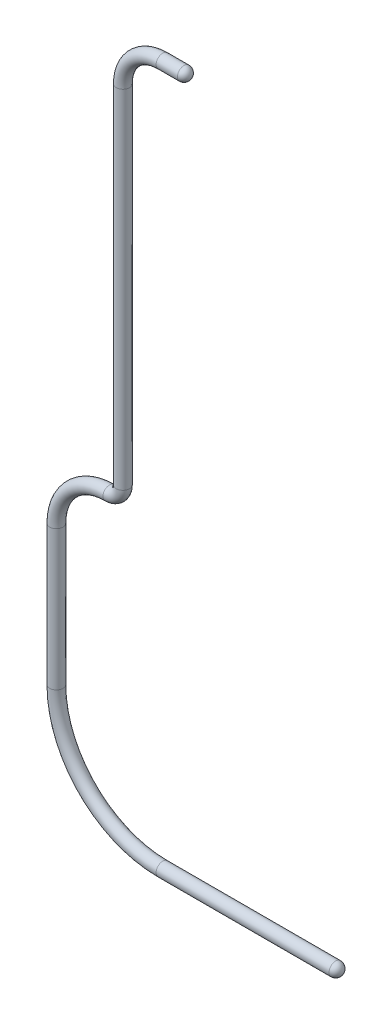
ISO-10303-21;
HEADER;
FILE_DESCRIPTION(('STEP AP214'),'2;1');
FILE_NAME('part.step','',(''),(''),'','','');
FILE_SCHEMA(('AUTOMOTIVE_DESIGN { 1 0 10303 214 1 1 1 1 }'));
ENDSEC;
DATA;
#1=APPLICATION_CONTEXT('core data for automotive mechanical design processes');
#2=APPLICATION_PROTOCOL_DEFINITION('international standard','automotive_design',2000,#1);
#3=PRODUCT_CONTEXT('',#1,'mechanical');
#4=PRODUCT('Part','Part','',(#3));
#5=PRODUCT_RELATED_PRODUCT_CATEGORY('part','',(#4));
#6=PRODUCT_DEFINITION_FORMATION('','',#4);
#7=PRODUCT_DEFINITION_CONTEXT('part definition',#1,'design');
#8=PRODUCT_DEFINITION('design','',#6,#7);
#9=PRODUCT_DEFINITION_SHAPE('','',#8);
#10=(LENGTH_UNIT() NAMED_UNIT(*) SI_UNIT(.MILLI.,.METRE.));
#11=(NAMED_UNIT(*) PLANE_ANGLE_UNIT() SI_UNIT($,.RADIAN.));
#12=(NAMED_UNIT(*) SI_UNIT($,.STERADIAN.) SOLID_ANGLE_UNIT());
#13=UNCERTAINTY_MEASURE_WITH_UNIT(LENGTH_MEASURE(1.E-05),#10,'distance_accuracy_value','');
#14=(GEOMETRIC_REPRESENTATION_CONTEXT(3) GLOBAL_UNCERTAINTY_ASSIGNED_CONTEXT((#13)) GLOBAL_UNIT_ASSIGNED_CONTEXT((#10,
#11,#12)) REPRESENTATION_CONTEXT('',''));
#15=CARTESIAN_POINT('',(0.,0.,0.));
#16=DIRECTION('',(0.,0.,1.));
#17=DIRECTION('',(1.,0.,0.));
#18=AXIS2_PLACEMENT_3D('',#15,#16,#17);
#19=CARTESIAN_POINT('',(-65.,-147.5,0.));
#20=DIRECTION('',(1.,0.,0.));
#21=DIRECTION('',(0.,0.,-1.));
#22=AXIS2_PLACEMENT_3D('',#19,#20,#21);
#23=CYLINDRICAL_SURFACE('',#22,2.5);
#24=CARTESIAN_POINT('',(0.,-147.5,0.));
#25=DIRECTION('',(1.,0.,0.));
#26=DIRECTION('',(0.,1.,0.));
#27=AXIS2_PLACEMENT_3D('',#24,#25,#26);
#28=CIRCLE('',#27,2.5);
#29=CARTESIAN_POINT('',(0.,-147.5,-2.5));
#30=VERTEX_POINT('',#29);
#31=CARTESIAN_POINT('',(0.,-147.5,2.5));
#32=VERTEX_POINT('',#31);
#33=EDGE_CURVE('E59',#30,#32,#28,.T.);
#34=ORIENTED_EDGE('',*,*,#33,.F.);
#35=CARTESIAN_POINT('',(0.,-147.5,0.));
#36=DIRECTION('',(-1.,0.,0.));
#37=DIRECTION('',(0.,-1.,0.));
#38=AXIS2_PLACEMENT_3D('',#35,#36,#37);
#39=CIRCLE('',#38,2.5);
#40=EDGE_CURVE('E37',#30,#32,#39,.T.);
#41=ORIENTED_EDGE('',*,*,#40,.T.);
#42=EDGE_LOOP('',(#34,#41));
#43=FACE_BOUND('',#42,.T.);
#44=CARTESIAN_POINT('',(-65.,-147.5,0.));
#45=DIRECTION('',(-1.,0.,0.));
#46=DIRECTION('',(0.,-1.,0.));
#47=AXIS2_PLACEMENT_3D('',#44,#45,#46);
#48=CIRCLE('',#47,2.5);
#49=CARTESIAN_POINT('',(-65.,-150.,0.));
#50=VERTEX_POINT('',#49);
#51=EDGE_CURVE('E11',#50,#50,#48,.T.);
#52=ORIENTED_EDGE('',*,*,#51,.F.);
#53=EDGE_LOOP('',(#52));
#54=FACE_BOUND('',#53,.T.);
#55=ADVANCED_FACE('F16',(#43,#54),#23,.T.);
#56=CARTESIAN_POINT('',(-65.,-107.5,0.));
#57=DIRECTION('',(0.,0.,-1.));
#58=DIRECTION('',(1.,0.,0.));
#59=AXIS2_PLACEMENT_3D('',#56,#57,#58);
#60=TOROIDAL_SURFACE('',#59,40.,2.5);
#61=CARTESIAN_POINT('',(-105.,-107.5,0.));
#62=DIRECTION('',(0.,1.,0.));
#63=DIRECTION('',(1.,0.,0.));
#64=AXIS2_PLACEMENT_3D('',#61,#62,#63);
#65=CIRCLE('',#64,2.5);
#66=CARTESIAN_POINT('',(-107.5,-107.5,0.));
#67=VERTEX_POINT('',#66);
#68=EDGE_CURVE('E24',#67,#67,#65,.T.);
#69=CARTESIAN_POINT('',(-65.,-107.5,0.));
#70=DIRECTION('',(0.,0.,-1.));
#71=DIRECTION('',(1.,0.,0.));
#72=AXIS2_PLACEMENT_3D('',#69,#70,#71);
#73=CIRCLE('',#72,42.5);
#74=EDGE_CURVE('',#50,#67,#73,.T.);
#75=ORIENTED_EDGE('',*,*,#51,.T.);
#76=ORIENTED_EDGE('',*,*,#68,.F.);
#77=ORIENTED_EDGE('',*,*,#74,.T.);
#78=ORIENTED_EDGE('',*,*,#74,.F.);
#79=EDGE_LOOP('',(#75,#77,#76,#78));
#80=FACE_BOUND('',#79,.T.);
#81=ADVANCED_FACE('F95',(#80),#60,.T.);
#82=CARTESIAN_POINT('',(-105.,-55.,0.));
#83=DIRECTION('',(0.,-1.,0.));
#84=DIRECTION('',(0.,0.,-1.));
#85=AXIS2_PLACEMENT_3D('',#82,#83,#84);
#86=CYLINDRICAL_SURFACE('',#85,2.5);
#87=ORIENTED_EDGE('',*,*,#68,.T.);
#88=EDGE_LOOP('',(#87));
#89=FACE_BOUND('',#88,.T.);
#90=CARTESIAN_POINT('',(-105.,-55.,0.));
#91=DIRECTION('',(0.,1.,0.));
#92=DIRECTION('',(1.,0.,0.));
#93=AXIS2_PLACEMENT_3D('',#90,#91,#92);
#94=CIRCLE('',#93,2.5);
#95=CARTESIAN_POINT('',(-107.5,-55.,0.));
#96=VERTEX_POINT('',#95);
#97=EDGE_CURVE('E79',#96,#96,#94,.T.);
#98=ORIENTED_EDGE('',*,*,#97,.F.);
#99=EDGE_LOOP('',(#98));
#100=FACE_BOUND('',#99,.T.);
#101=ADVANCED_FACE('F92',(#89,#100),#86,.T.);
#102=CARTESIAN_POINT('',(-85.,-55.,0.));
#103=DIRECTION('',(0.,0.,-1.));
#104=DIRECTION('',(1.,0.,0.));
#105=AXIS2_PLACEMENT_3D('',#102,#103,#104);
#106=TOROIDAL_SURFACE('',#105,20.,2.5);
#107=CARTESIAN_POINT('',(-85.,-35.,0.));
#108=DIRECTION('',(1.,0.,0.));
#109=DIRECTION('',(0.,-1.,0.));
#110=AXIS2_PLACEMENT_3D('',#107,#108,#109);
#111=CIRCLE('',#110,2.5);
#112=CARTESIAN_POINT('',(-85.,-32.5,0.));
#113=VERTEX_POINT('',#112);
#114=EDGE_CURVE('E75',#113,#113,#111,.T.);
#115=CARTESIAN_POINT('',(-85.,-55.,0.));
#116=DIRECTION('',(0.,0.,-1.));
#117=DIRECTION('',(1.,0.,0.));
#118=AXIS2_PLACEMENT_3D('',#115,#116,#117);
#119=CIRCLE('',#118,22.5);
#120=EDGE_CURVE('',#96,#113,#119,.T.);
#121=ORIENTED_EDGE('',*,*,#97,.T.);
#122=ORIENTED_EDGE('',*,*,#114,.F.);
#123=ORIENTED_EDGE('',*,*,#120,.T.);
#124=ORIENTED_EDGE('',*,*,#120,.F.);
#125=EDGE_LOOP('',(#121,#123,#122,#124));
#126=FACE_BOUND('',#125,.T.);
#127=ADVANCED_FACE('F103',(#126),#106,.T.);
#128=CARTESIAN_POINT('',(-85.,-30.,0.));
#129=DIRECTION('',(0.,0.,1.));
#130=DIRECTION('',(-1.,0.,0.));
#131=AXIS2_PLACEMENT_3D('',#128,#129,#130);
#132=TOROIDAL_SURFACE('',#131,5.,2.5);
#133=ORIENTED_EDGE('',*,*,#114,.T.);
#134=EDGE_LOOP('',(#133));
#135=FACE_BOUND('',#134,.T.);
#136=CARTESIAN_POINT('',(-80.,-30.,0.));
#137=DIRECTION('',(0.,1.,0.));
#138=DIRECTION('',(1.,0.,0.));
#139=AXIS2_PLACEMENT_3D('',#136,#137,#138);
#140=CIRCLE('',#139,2.5);
#141=CARTESIAN_POINT('',(-77.5,-30.,0.));
#142=VERTEX_POINT('',#141);
#143=EDGE_CURVE('E71',#142,#142,#140,.T.);
#144=ORIENTED_EDGE('',*,*,#143,.F.);
#145=EDGE_LOOP('',(#144));
#146=FACE_BOUND('',#145,.T.);
#147=ADVANCED_FACE('F108',(#135,#146),#132,.T.);
#148=CARTESIAN_POINT('',(-80.,100.58,0.));
#149=DIRECTION('',(0.,-1.,0.));
#150=DIRECTION('',(0.,0.,-1.));
#151=AXIS2_PLACEMENT_3D('',#148,#149,#150);
#152=CYLINDRICAL_SURFACE('',#151,2.5);
#153=ORIENTED_EDGE('',*,*,#143,.T.);
#154=EDGE_LOOP('',(#153));
#155=FACE_BOUND('',#154,.T.);
#156=CARTESIAN_POINT('',(-80.,100.58,0.));
#157=DIRECTION('',(0.,1.,0.));
#158=DIRECTION('',(1.,0.,0.));
#159=AXIS2_PLACEMENT_3D('',#156,#157,#158);
#160=CIRCLE('',#159,2.5);
#161=CARTESIAN_POINT('',(-82.5,100.58,0.));
#162=VERTEX_POINT('',#161);
#163=EDGE_CURVE('E67',#162,#162,#160,.T.);
#164=ORIENTED_EDGE('',*,*,#163,.F.);
#165=EDGE_LOOP('',(#164));
#166=FACE_BOUND('',#165,.T.);
#167=ADVANCED_FACE('F112',(#155,#166),#152,.T.);
#168=CARTESIAN_POINT('',(-65.,100.58,0.));
#169=DIRECTION('',(0.,0.,-1.));
#170=DIRECTION('',(1.,0.,0.));
#171=AXIS2_PLACEMENT_3D('',#168,#169,#170);
#172=TOROIDAL_SURFACE('',#171,15.,2.5);
#173=CARTESIAN_POINT('',(-65.,115.58,0.));
#174=DIRECTION('',(1.,0.,0.));
#175=DIRECTION('',(0.,-1.,0.));
#176=AXIS2_PLACEMENT_3D('',#173,#174,#175);
#177=CIRCLE('',#176,2.5);
#178=CARTESIAN_POINT('',(-65.,118.08,0.));
#179=VERTEX_POINT('',#178);
#180=EDGE_CURVE('E64',#179,#179,#177,.T.);
#181=CARTESIAN_POINT('',(-65.,100.58,0.));
#182=DIRECTION('',(0.,0.,-1.));
#183=DIRECTION('',(1.,0.,0.));
#184=AXIS2_PLACEMENT_3D('',#181,#182,#183);
#185=CIRCLE('',#184,17.5);
#186=EDGE_CURVE('',#162,#179,#185,.T.);
#187=ORIENTED_EDGE('',*,*,#163,.T.);
#188=ORIENTED_EDGE('',*,*,#180,.F.);
#189=ORIENTED_EDGE('',*,*,#186,.T.);
#190=ORIENTED_EDGE('',*,*,#186,.F.);
#191=EDGE_LOOP('',(#187,#189,#188,#190));
#192=FACE_BOUND('',#191,.T.);
#193=ADVANCED_FACE('F116',(#192),#172,.T.);
#194=CARTESIAN_POINT('',(-57.,115.58,0.));
#195=DIRECTION('',(-1.,0.,0.));
#196=DIRECTION('',(0.,0.,-1.));
#197=AXIS2_PLACEMENT_3D('',#194,#195,#196);
#198=CYLINDRICAL_SURFACE('',#197,2.5);
#199=ORIENTED_EDGE('',*,*,#180,.T.);
#200=EDGE_LOOP('',(#199));
#201=FACE_BOUND('',#200,.T.);
#202=CARTESIAN_POINT('',(-57.,115.58,0.));
#203=DIRECTION('',(1.,0.,0.));
#204=DIRECTION('',(0.,1.,0.));
#205=AXIS2_PLACEMENT_3D('',#202,#203,#204);
#206=CIRCLE('',#205,2.5);
#207=CARTESIAN_POINT('',(-57.,115.58,-2.5));
#208=VERTEX_POINT('',#207);
#209=CARTESIAN_POINT('',(-57.,115.58,2.5));
#210=VERTEX_POINT('',#209);
#211=EDGE_CURVE('E44',#208,#210,#206,.T.);
#212=ORIENTED_EDGE('',*,*,#211,.F.);
#213=CARTESIAN_POINT('',(-57.,115.58,0.));
#214=DIRECTION('',(-1.,0.,0.));
#215=DIRECTION('',(0.,-1.,0.));
#216=AXIS2_PLACEMENT_3D('',#213,#214,#215);
#217=CIRCLE('',#216,2.5);
#218=EDGE_CURVE('E30',#208,#210,#217,.T.);
#219=ORIENTED_EDGE('',*,*,#218,.T.);
#220=EDGE_LOOP('',(#212,#219));
#221=FACE_BOUND('',#220,.T.);
#222=ADVANCED_FACE('F47',(#201,#221),#198,.T.);
#223=CARTESIAN_POINT('',(0.,-147.5,0.));
#224=DIRECTION('',(0.,0.,1.));
#225=DIRECTION('',(0.,1.,0.));
#226=AXIS2_PLACEMENT_3D('',#223,#224,#225);
#227=SPHERICAL_SURFACE('',#226,2.5);
#228=CARTESIAN_POINT('',(0.,-147.5,0.));
#229=DIRECTION('',(1.,0.,0.));
#230=DIRECTION('',(0.,1.,0.));
#231=AXIS2_PLACEMENT_3D('',#228,#229,#230);
#232=SPHERICAL_SURFACE('',#231,2.5);
#233=ORIENTED_EDGE('',*,*,#33,.T.);
#234=ORIENTED_EDGE('',*,*,#40,.F.);
#235=EDGE_LOOP('',(#233,#234));
#236=FACE_BOUND('',#235,.T.);
#237=ADVANCED_FACE('F123',(#236),#232,.T.);
#238=CARTESIAN_POINT('',(-57.,115.58,0.));
#239=DIRECTION('',(0.,0.,1.));
#240=DIRECTION('',(0.,1.,0.));
#241=AXIS2_PLACEMENT_3D('',#238,#239,#240);
#242=SPHERICAL_SURFACE('',#241,2.5);
#243=CARTESIAN_POINT('',(-57.,115.58,0.));
#244=DIRECTION('',(1.,0.,0.));
#245=DIRECTION('',(0.,1.,0.));
#246=AXIS2_PLACEMENT_3D('',#243,#244,#245);
#247=SPHERICAL_SURFACE('',#246,2.5);
#248=ORIENTED_EDGE('',*,*,#211,.T.);
#249=ORIENTED_EDGE('',*,*,#218,.F.);
#250=EDGE_LOOP('',(#248,#249));
#251=FACE_BOUND('',#250,.T.);
#252=ADVANCED_FACE('F43',(#251),#247,.T.);
#253=CLOSED_SHELL('',(#55,#81,#101,#127,#147,#167,#193,#222,#237,#252));
#254=MANIFOLD_SOLID_BREP('B1',#253);
#255=ADVANCED_BREP_SHAPE_REPRESENTATION('',(#18,#254),#14);
#256=SHAPE_DEFINITION_REPRESENTATION(#9,#255);
ENDSEC;
END-ISO-10303-21;
